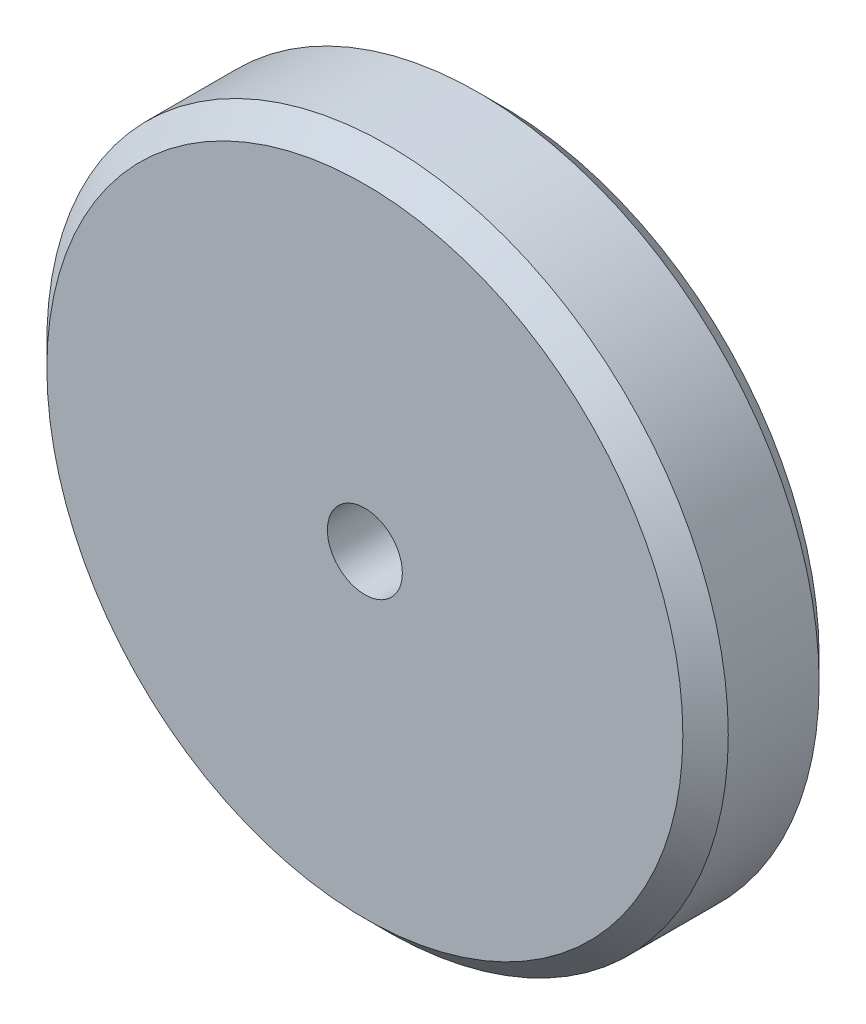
ISO-10303-21;
HEADER;
FILE_DESCRIPTION(('STEP AP214'),'2;1');
FILE_NAME('part.step','',(''),(''),'','','');
FILE_SCHEMA(('AUTOMOTIVE_DESIGN { 1 0 10303 214 1 1 1 1 }'));
ENDSEC;
DATA;
#1=APPLICATION_CONTEXT('core data for automotive mechanical design processes');
#2=APPLICATION_PROTOCOL_DEFINITION('international standard','automotive_design',2000,#1);
#3=PRODUCT_CONTEXT('',#1,'mechanical');
#4=PRODUCT('Part','Part','',(#3));
#5=PRODUCT_RELATED_PRODUCT_CATEGORY('part','',(#4));
#6=PRODUCT_DEFINITION_FORMATION('','',#4);
#7=PRODUCT_DEFINITION_CONTEXT('part definition',#1,'design');
#8=PRODUCT_DEFINITION('design','',#6,#7);
#9=PRODUCT_DEFINITION_SHAPE('','',#8);
#10=(LENGTH_UNIT() NAMED_UNIT(*) SI_UNIT(.MILLI.,.METRE.));
#11=(NAMED_UNIT(*) PLANE_ANGLE_UNIT() SI_UNIT($,.RADIAN.));
#12=(NAMED_UNIT(*) SI_UNIT($,.STERADIAN.) SOLID_ANGLE_UNIT());
#13=UNCERTAINTY_MEASURE_WITH_UNIT(LENGTH_MEASURE(1.E-05),#10,'distance_accuracy_value','');
#14=(GEOMETRIC_REPRESENTATION_CONTEXT(3) GLOBAL_UNCERTAINTY_ASSIGNED_CONTEXT((#13)) GLOBAL_UNIT_ASSIGNED_CONTEXT((#10,
#11,#12)) REPRESENTATION_CONTEXT('',''));
#15=CARTESIAN_POINT('',(0.,0.,0.));
#16=DIRECTION('',(0.,0.,1.));
#17=DIRECTION('',(1.,0.,0.));
#18=AXIS2_PLACEMENT_3D('',#15,#16,#17);
#19=CARTESIAN_POINT('',(0.,0.,6.));
#20=DIRECTION('',(0.,0.,-1.));
#21=DIRECTION('',(-1.,0.,0.));
#22=AXIS2_PLACEMENT_3D('',#19,#20,#21);
#23=CYLINDRICAL_SURFACE('',#22,15.);
#24=CARTESIAN_POINT('',(0.,0.,0.999999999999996));
#25=DIRECTION('',(0.,0.,1.));
#26=DIRECTION('',(1.,0.,0.));
#27=AXIS2_PLACEMENT_3D('',#24,#25,#26);
#28=CIRCLE('',#27,15.);
#29=CARTESIAN_POINT('',(15.,0.,0.999999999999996));
#30=VERTEX_POINT('',#29);
#31=EDGE_CURVE('E40',#30,#30,#28,.T.);
#32=ORIENTED_EDGE('',*,*,#31,.T.);
#33=EDGE_LOOP('',(#32));
#34=FACE_BOUND('',#33,.T.);
#35=CARTESIAN_POINT('',(0.,0.,4.99999999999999));
#36=DIRECTION('',(0.,0.,1.));
#37=DIRECTION('',(1.,0.,0.));
#38=AXIS2_PLACEMENT_3D('',#35,#36,#37);
#39=CIRCLE('',#38,15.);
#40=CARTESIAN_POINT('',(15.,0.,4.99999999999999));
#41=VERTEX_POINT('',#40);
#42=EDGE_CURVE('E44',#41,#41,#39,.F.);
#43=ORIENTED_EDGE('',*,*,#42,.T.);
#44=EDGE_LOOP('',(#43));
#45=FACE_BOUND('',#44,.T.);
#46=ADVANCED_FACE('F29',(#34,#45),#23,.T.);
#47=CARTESIAN_POINT('',(0.,0.,6.));
#48=DIRECTION('',(0.,0.,1.));
#49=DIRECTION('',(1.,0.,0.));
#50=AXIS2_PLACEMENT_3D('',#47,#48,#49);
#51=PLANE('',#50);
#52=CARTESIAN_POINT('',(0.,0.,6.));
#53=DIRECTION('',(0.,0.,1.));
#54=DIRECTION('',(1.,0.,0.));
#55=AXIS2_PLACEMENT_3D('',#52,#53,#54);
#56=CIRCLE('',#55,14.);
#57=CARTESIAN_POINT('',(14.,0.,6.));
#58=VERTEX_POINT('',#57);
#59=EDGE_CURVE('E10',#58,#58,#56,.T.);
#60=ORIENTED_EDGE('',*,*,#59,.T.);
#61=EDGE_LOOP('',(#60));
#62=FACE_BOUND('',#61,.T.);
#63=CARTESIAN_POINT('',(0.,0.,6.));
#64=DIRECTION('',(0.,0.,1.));
#65=DIRECTION('',(1.,0.,0.));
#66=AXIS2_PLACEMENT_3D('',#63,#64,#65);
#67=CIRCLE('',#66,1.65);
#68=CARTESIAN_POINT('',(1.65,0.,6.));
#69=VERTEX_POINT('',#68);
#70=EDGE_CURVE('E52',#69,#69,#67,.T.);
#71=ORIENTED_EDGE('',*,*,#70,.F.);
#72=EDGE_LOOP('',(#71));
#73=FACE_BOUND('',#72,.T.);
#74=ADVANCED_FACE('F58',(#62,#73),#51,.T.);
#75=CARTESIAN_POINT('',(0.,0.,0.));
#76=DIRECTION('',(0.,0.,1.));
#77=DIRECTION('',(1.,0.,0.));
#78=AXIS2_PLACEMENT_3D('',#75,#76,#77);
#79=PLANE('',#78);
#80=CARTESIAN_POINT('',(0.,0.,0.));
#81=DIRECTION('',(0.,0.,1.));
#82=DIRECTION('',(1.,0.,0.));
#83=AXIS2_PLACEMENT_3D('',#80,#81,#82);
#84=CIRCLE('',#83,14.);
#85=CARTESIAN_POINT('',(14.,0.,0.));
#86=VERTEX_POINT('',#85);
#87=EDGE_CURVE('E36',#86,#86,#84,.F.);
#88=ORIENTED_EDGE('',*,*,#87,.T.);
#89=EDGE_LOOP('',(#88));
#90=FACE_BOUND('',#89,.T.);
#91=CARTESIAN_POINT('',(0.,0.,0.));
#92=DIRECTION('',(0.,0.,1.));
#93=DIRECTION('',(1.,0.,0.));
#94=AXIS2_PLACEMENT_3D('',#91,#92,#93);
#95=CIRCLE('',#94,1.65);
#96=CARTESIAN_POINT('',(1.65,0.,0.));
#97=VERTEX_POINT('',#96);
#98=EDGE_CURVE('E49',#97,#97,#95,.T.);
#99=ORIENTED_EDGE('',*,*,#98,.T.);
#100=EDGE_LOOP('',(#99));
#101=FACE_BOUND('',#100,.T.);
#102=ADVANCED_FACE('F60',(#90,#101),#79,.F.);
#103=CARTESIAN_POINT('',(0.,0.,6.));
#104=DIRECTION('',(0.,0.,1.));
#105=DIRECTION('',(1.,0.,0.));
#106=AXIS2_PLACEMENT_3D('',#103,#104,#105);
#107=CYLINDRICAL_SURFACE('',#106,1.65);
#108=ORIENTED_EDGE('',*,*,#98,.F.);
#109=EDGE_LOOP('',(#108));
#110=FACE_BOUND('',#109,.T.);
#111=ORIENTED_EDGE('',*,*,#70,.T.);
#112=EDGE_LOOP('',(#111));
#113=FACE_BOUND('',#112,.T.);
#114=ADVANCED_FACE('F56',(#110,#113),#107,.F.);
#115=CARTESIAN_POINT('',(0.,0.,0.999999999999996));
#116=DIRECTION('',(0.,0.,1.));
#117=DIRECTION('',(1.,0.,0.));
#118=AXIS2_PLACEMENT_3D('',#115,#116,#117);
#119=CONICAL_SURFACE('',#118,15.,0.785398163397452);
#120=ORIENTED_EDGE('',*,*,#87,.F.);
#121=EDGE_LOOP('',(#120));
#122=FACE_BOUND('',#121,.T.);
#123=ORIENTED_EDGE('',*,*,#31,.F.);
#124=EDGE_LOOP('',(#123));
#125=FACE_BOUND('',#124,.T.);
#126=ADVANCED_FACE('F70',(#122,#125),#119,.T.);
#127=CARTESIAN_POINT('',(0.,0.,6.));
#128=DIRECTION('',(0.,0.,-1.));
#129=DIRECTION('',(-1.,0.,0.));
#130=AXIS2_PLACEMENT_3D('',#127,#128,#129);
#131=CONICAL_SURFACE('',#130,14.,0.785398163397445);
#132=ORIENTED_EDGE('',*,*,#42,.F.);
#133=EDGE_LOOP('',(#132));
#134=FACE_BOUND('',#133,.T.);
#135=ORIENTED_EDGE('',*,*,#59,.F.);
#136=EDGE_LOOP('',(#135));
#137=FACE_BOUND('',#136,.T.);
#138=ADVANCED_FACE('F31',(#134,#137),#131,.T.);
#139=CLOSED_SHELL('',(#46,#74,#102,#114,#126,#138));
#140=MANIFOLD_SOLID_BREP('B2',#139);
#141=ADVANCED_BREP_SHAPE_REPRESENTATION('',(#18,#140),#14);
#142=SHAPE_DEFINITION_REPRESENTATION(#9,#141);
ENDSEC;
END-ISO-10303-21;
